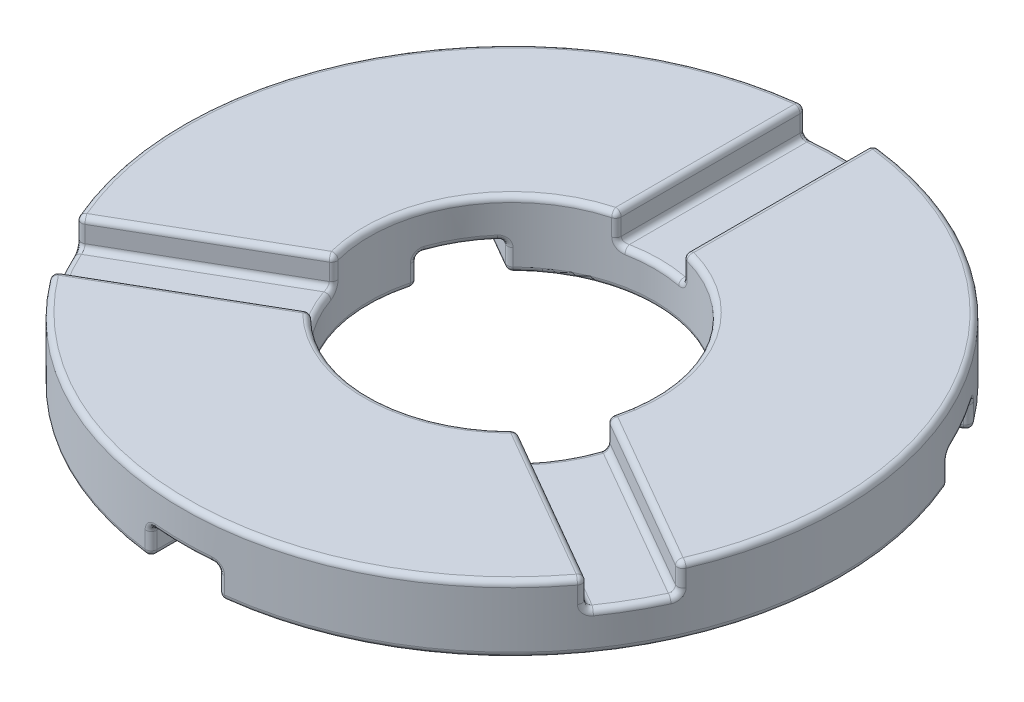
from build123d import *

# Parameters (mm, degrees)
SKETCH1_R          = 7.493
SKETCH1_R_2        = 3.2385
EXTRUDE1_DEPTH     = 1.524
SKETCH2_W          = 1.524
SKETCH2_H          = 7.160145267
CUT_EXTRUDE1_DEPTH = 0.635
CIRPATTERN1_COUNT  = 3
SKETCH3_W          = 1.524
SKETCH3_H          = 6.117389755
CUT_EXTRUDE2_DEPTH = 0.635
CIRPATTERN2_COUNT  = 3
FILLET1_R          = 0.127


with BuildPart() as part:
    # Sketch1 → Extrude1 (new body)
    with BuildSketch(Plane(origin=(0, 0, 0), x_dir=(1, 0, 0), z_dir=(0, 1, 0))):
        with Locations(Location((0, 0, 0), (0, 0, 90))):
            Circle(SKETCH1_R)
        with Locations(Location((0, 0, 0), (0, 0, 90))):
            Circle(SKETCH1_R_2, mode=Mode.SUBTRACT)
    extrude(amount=EXTRUDE1_DEPTH)

    # Sketch2 → Cut-Extrude1 (cut)
    with BuildSketch(Plane(origin=(0, 0, 0), x_dir=(1, 0, 0), z_dir=(0, 1, 0))):
        with Locations((0, -5.196624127)):
            Rectangle(SKETCH2_W, SKETCH2_H)
    cut_extrude1 = extrude(amount=CUT_EXTRUDE1_DEPTH, mode=Mode.SUBTRACT)

    # CirPattern1: Cut-Extrude1 ×3 about axis
    cirpattern1_axis = Axis((0, 0, 0), (0, 1, 0))
    for i in range(1, CIRPATTERN1_COUNT):
        add(cut_extrude1.rotate(cirpattern1_axis, i * 360 / CIRPATTERN1_COUNT), mode=Mode.SUBTRACT)

    # Sketch3 → Cut-Extrude2 (cut)
    with BuildSketch(Plane(origin=(0, 1.524, 0), x_dir=(-1, 0, 0), z_dir=(0, 1, 0))):
        with Locations((0, -5.262013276)):
            Rectangle(SKETCH3_W, SKETCH3_H)
    cut_extrude2 = extrude(amount=-CUT_EXTRUDE2_DEPTH, mode=Mode.SUBTRACT)

    # CirPattern2: Cut-Extrude2 ×3 about axis
    cirpattern2_axis = Axis((0, 0, 0), (0, 1, 0))
    for i in range(1, CIRPATTERN2_COUNT):
        add(cut_extrude2.rotate(cirpattern2_axis, i * 360 / CIRPATTERN2_COUNT), mode=Mode.SUBTRACT)

    # Fillet1
    fillet1_edges = [part.edges().sort_by_distance(p)[0] for p in [
        (0, 0.635, 3.2385),
        (0.762, 0.3175, 3.147576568),
        (-0.762, 0.3175, 3.147576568),
        (-0.762, 0, 5.300865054),
        (0.762, 0, 5.300865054),
        (0.762, 0.635, 5.300865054),
        (-0.762, 0.635, 5.300865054),
        (-0.762, 0.3175, 7.45415354),
        (0.762, 0.3175, 7.45415354),
        (6.489128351, 0, 3.7465),
        (0, 0.635, 7.493),
        (-2.80462327, 0, 1.61925),
        (-6.489128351, 0, 3.7465),
        (-6.836486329, 0.3175, -3.067165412),
        (-6.489128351, 0.635, -3.7465),
        (-6.074486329, 0.3175, -4.386988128),
        (-2.344881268, 0.3175, -2.233699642),
        (-4.209683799, 0, -3.310343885),
        (-4.971683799, 0, -1.990521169),
        (-3.106881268, 0.3175, -0.913876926),
        (-4.971683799, 0.635, -1.990521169),
        (-2.80462327, 0.635, -1.61925),
        (-4.209683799, 0.635, -3.310343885),
        (-1.27554811, 0, -2.976719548),
        (-3.411256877, 0, -6.671459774),
        (6.074486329, 0.3175, -4.386988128),
        (2.80462327, 0, 1.61925),
        (6.489128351, 0.635, -3.7465),
        (6.836486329, 0.3175, -3.067165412),
        (3.106881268, 0.3175, -0.913876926),
        (4.971683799, 0, -1.990521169),
        (4.209683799, 0, -3.310343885),
        (2.344881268, 0.3175, -2.233699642),
        (4.209683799, 0.635, -3.310343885),
        (2.80462327, 0.635, -1.61925),
        (4.971683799, 0.635, -1.990521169),
        (-6.489128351, 1.524, -3.7465),
        (-2.80462327, 1.524, -1.61925),
        (-0.762, 1.524, -5.300865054),
        (0.762, 1.524, -5.300865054),
        (-0.383702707, 0.889, -3.215688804),
        (0.762, 0.889, -5.300865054),
        (0.762, 1.2065, -7.45415354),
        (0.762, 1.2065, -3.147576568),
        (-0.762, 1.2065, -7.45415354),
        (-0.762, 0.889, -5.300865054),
        (-0.762, 1.2065, -3.147576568),
        (-0.381494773, 0.889, -7.483282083),
        (2.80462327, 1.524, -1.61925),
        (6.489128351, 1.524, -3.7465),
        (6.489128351, 0.889, 3.7465),
        (3.106881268, 1.2065, 0.913876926),
        (2.344881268, 1.2065, 2.233699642),
        (4.971683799, 1.524, 1.990521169),
        (4.209683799, 1.524, 3.310343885),
        (4.209683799, 0.889, 3.310343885),
        (6.074486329, 1.2065, 4.386988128),
        (2.80462327, 0.889, 1.61925),
        (6.836486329, 1.2065, 3.067165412),
        (4.971683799, 0.889, 1.990521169),
        (0, 1.524, 3.2385),
        (0, 1.524, 7.493),
        (-6.489128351, 0.889, 3.7465),
        (-2.344881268, 1.2065, 2.233699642),
        (-3.106881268, 1.2065, 0.913876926),
        (-4.209683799, 1.524, 3.310343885),
        (-4.971683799, 1.524, 1.990521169),
        (-4.971683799, 0.889, 1.990521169),
        (-6.836486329, 1.2065, 3.067165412),
        (-2.80462327, 0.889, 1.61925),
        (-6.074486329, 1.2065, 4.386988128),
        (-4.209683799, 0.889, 3.310343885),
    ]]
    fillet(fillet1_edges, radius=FILLET1_R)


solid = part.part
